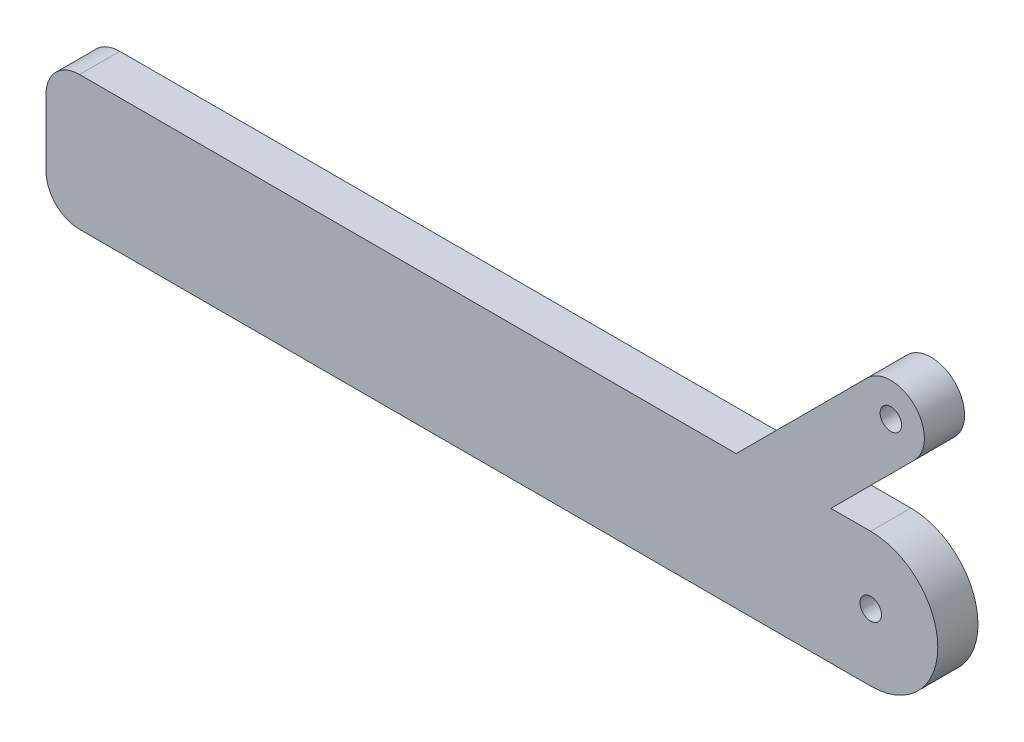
from build123d import *

# Parameters (mm, degrees)
ESQUISSE1_R        = 1.6
BOSS_EXTRU_1_DEPTH = 6


with BuildPart() as part:
    # Esquisse1 → Boss.-Extru.1 (new body)
    with BuildSketch(Plane.XY):
        with BuildLine():
            Line((23, 10), (17.071067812, 10))
            Line((17.071067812, 10), (29.535533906, 22.464466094))
            ThreePointArc((29.535533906, 22.464466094), (29.535533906, 29.535533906), (22.464466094, 29.535533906))
            Line((22.464466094, 29.535533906), (2.928932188, 10))
            Line((2.928932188, 10), (-95, 10))
            ThreePointArc((-95, 10), (-98.535533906, 8.535533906), (-100, 5))
            Line((-100, 5), (-100, -5))
            ThreePointArc((-100, -5), (-98.535533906, -8.535533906), (-95, -10))
            Line((-95, -10), (23, -10))
            ThreePointArc((23, -10), (33, 0), (23, 10))
        make_face()
        with Locations((23, 0)):
            Circle(ESQUISSE1_R, mode=Mode.SUBTRACT)
        with Locations((26, 26)):
            Circle(ESQUISSE1_R, mode=Mode.SUBTRACT)
    extrude(amount=BOSS_EXTRU_1_DEPTH)


solid = part.part
